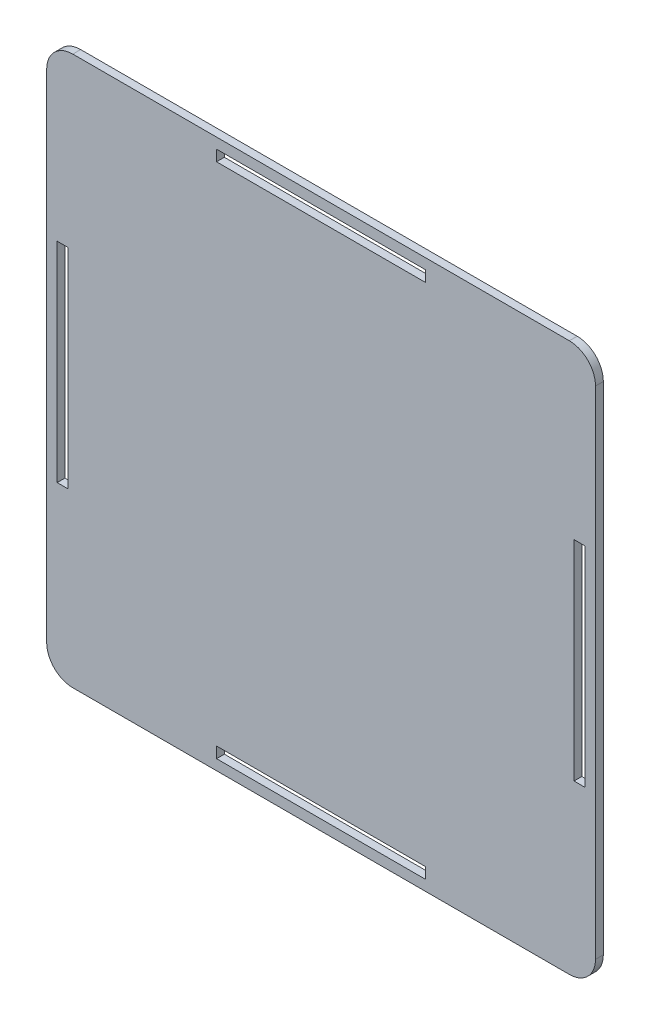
ISO-10303-21;
HEADER;
FILE_DESCRIPTION(('STEP AP214'),'2;1');
FILE_NAME('part.step','',(''),(''),'','','');
FILE_SCHEMA(('AUTOMOTIVE_DESIGN { 1 0 10303 214 1 1 1 1 }'));
ENDSEC;
DATA;
#1=APPLICATION_CONTEXT('core data for automotive mechanical design processes');
#2=APPLICATION_PROTOCOL_DEFINITION('international standard','automotive_design',2000,#1);
#3=PRODUCT_CONTEXT('',#1,'mechanical');
#4=PRODUCT('Part','Part','',(#3));
#5=PRODUCT_RELATED_PRODUCT_CATEGORY('part','',(#4));
#6=PRODUCT_DEFINITION_FORMATION('','',#4);
#7=PRODUCT_DEFINITION_CONTEXT('part definition',#1,'design');
#8=PRODUCT_DEFINITION('design','',#6,#7);
#9=PRODUCT_DEFINITION_SHAPE('','',#8);
#10=(LENGTH_UNIT() NAMED_UNIT(*) SI_UNIT(.MILLI.,.METRE.));
#11=(NAMED_UNIT(*) PLANE_ANGLE_UNIT() SI_UNIT($,.RADIAN.));
#12=(NAMED_UNIT(*) SI_UNIT($,.STERADIAN.) SOLID_ANGLE_UNIT());
#13=UNCERTAINTY_MEASURE_WITH_UNIT(LENGTH_MEASURE(1.E-05),#10,'distance_accuracy_value','');
#14=(GEOMETRIC_REPRESENTATION_CONTEXT(3) GLOBAL_UNCERTAINTY_ASSIGNED_CONTEXT((#13)) GLOBAL_UNIT_ASSIGNED_CONTEXT((#10,
#11,#12)) REPRESENTATION_CONTEXT('',''));
#15=CARTESIAN_POINT('',(0.,0.,0.));
#16=DIRECTION('',(0.,0.,1.));
#17=DIRECTION('',(1.,0.,0.));
#18=AXIS2_PLACEMENT_3D('',#15,#16,#17);
#19=CARTESIAN_POINT('',(-47.4999999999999,-47.5,1.5));
#20=DIRECTION('',(0.,0.,1.));
#21=DIRECTION('',(1.,0.,0.));
#22=AXIS2_PLACEMENT_3D('',#19,#20,#21);
#23=PLANE('',#22);
#24=CARTESIAN_POINT('',(-47.4999999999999,-47.5,1.5));
#25=DIRECTION('',(0.,0.,1.));
#26=DIRECTION('',(1.,0.,0.));
#27=AXIS2_PLACEMENT_3D('',#24,#25,#26);
#28=CIRCLE('',#27,5.);
#29=CARTESIAN_POINT('',(-52.4999999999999,-47.5,1.5));
#30=VERTEX_POINT('',#29);
#31=CARTESIAN_POINT('',(-47.4999999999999,-52.5,1.5));
#32=VERTEX_POINT('',#31);
#33=EDGE_CURVE('E378',#30,#32,#28,.T.);
#34=ORIENTED_EDGE('',*,*,#33,.T.);
#35=DIRECTION('',(1.,0.,0.));
#36=VECTOR('',#35,1.);
#37=CARTESIAN_POINT('',(-47.4999999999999,-52.5,1.5));
#38=LINE('',#37,#36);
#39=CARTESIAN_POINT('',(47.5,-52.5,1.5));
#40=VERTEX_POINT('',#39);
#41=EDGE_CURVE('E382',#32,#40,#38,.T.);
#42=ORIENTED_EDGE('',*,*,#41,.T.);
#43=CARTESIAN_POINT('',(47.5,-47.5,1.5));
#44=DIRECTION('',(0.,0.,1.));
#45=DIRECTION('',(1.,0.,0.));
#46=AXIS2_PLACEMENT_3D('',#43,#44,#45);
#47=CIRCLE('',#46,5.);
#48=CARTESIAN_POINT('',(52.5,-47.5,1.5));
#49=VERTEX_POINT('',#48);
#50=EDGE_CURVE('E386',#40,#49,#47,.T.);
#51=ORIENTED_EDGE('',*,*,#50,.T.);
#52=DIRECTION('',(0.,1.,0.));
#53=VECTOR('',#52,1.);
#54=CARTESIAN_POINT('',(52.5,47.4999999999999,1.5));
#55=LINE('',#54,#53);
#56=CARTESIAN_POINT('',(52.5,47.4999999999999,1.5));
#57=VERTEX_POINT('',#56);
#58=EDGE_CURVE('E389',#49,#57,#55,.T.);
#59=ORIENTED_EDGE('',*,*,#58,.T.);
#60=CARTESIAN_POINT('',(47.5,47.5,1.5));
#61=DIRECTION('',(0.,0.,1.));
#62=DIRECTION('',(-1.,0.,0.));
#63=AXIS2_PLACEMENT_3D('',#60,#61,#62);
#64=CIRCLE('',#63,5.);
#65=CARTESIAN_POINT('',(47.5,52.5,1.5));
#66=VERTEX_POINT('',#65);
#67=EDGE_CURVE('E392',#57,#66,#64,.T.);
#68=ORIENTED_EDGE('',*,*,#67,.T.);
#69=DIRECTION('',(-1.,0.,0.));
#70=VECTOR('',#69,1.);
#71=CARTESIAN_POINT('',(-47.4999999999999,52.5,1.5));
#72=LINE('',#71,#70);
#73=CARTESIAN_POINT('',(-47.4999999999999,52.5,1.5));
#74=VERTEX_POINT('',#73);
#75=EDGE_CURVE('E395',#66,#74,#72,.T.);
#76=ORIENTED_EDGE('',*,*,#75,.T.);
#77=CARTESIAN_POINT('',(-47.4999999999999,47.5,1.5));
#78=DIRECTION('',(0.,0.,1.));
#79=DIRECTION('',(1.,0.,0.));
#80=AXIS2_PLACEMENT_3D('',#77,#78,#79);
#81=CIRCLE('',#80,5.);
#82=CARTESIAN_POINT('',(-52.4999999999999,47.4999999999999,1.5));
#83=VERTEX_POINT('',#82);
#84=EDGE_CURVE('E398',#74,#83,#81,.T.);
#85=ORIENTED_EDGE('',*,*,#84,.T.);
#86=DIRECTION('',(0.,-1.,0.));
#87=VECTOR('',#86,1.);
#88=CARTESIAN_POINT('',(-52.4999999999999,47.4999999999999,1.5));
#89=LINE('',#88,#87);
#90=EDGE_CURVE('E401',#83,#30,#89,.T.);
#91=ORIENTED_EDGE('',*,*,#90,.T.);
#92=EDGE_LOOP('',(#34,#42,#51,#59,#68,#76,#85,#91));
#93=FACE_BOUND('',#92,.T.);
#94=DIRECTION('',(1.,0.,0.));
#95=VECTOR('',#94,1.);
#96=CARTESIAN_POINT('',(-50.4999999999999,-20.,1.5));
#97=LINE('',#96,#95);
#98=CARTESIAN_POINT('',(-50.4999999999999,-20.,1.5));
#99=VERTEX_POINT('',#98);
#100=CARTESIAN_POINT('',(-48.3999999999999,-20.,1.5));
#101=VERTEX_POINT('',#100);
#102=EDGE_CURVE('E338',#99,#101,#97,.T.);
#103=ORIENTED_EDGE('',*,*,#102,.F.);
#104=DIRECTION('',(0.,-1.,0.));
#105=VECTOR('',#104,1.);
#106=CARTESIAN_POINT('',(-50.4999999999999,20.,1.5));
#107=LINE('',#106,#105);
#108=CARTESIAN_POINT('',(-50.4999999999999,20.,1.5));
#109=VERTEX_POINT('',#108);
#110=EDGE_CURVE('E335',#109,#99,#107,.T.);
#111=ORIENTED_EDGE('',*,*,#110,.F.);
#112=DIRECTION('',(-1.,0.,0.));
#113=VECTOR('',#112,1.);
#114=CARTESIAN_POINT('',(-50.4999999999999,20.,1.5));
#115=LINE('',#114,#113);
#116=CARTESIAN_POINT('',(-48.3999999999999,20.,1.5));
#117=VERTEX_POINT('',#116);
#118=EDGE_CURVE('E346',#117,#109,#115,.T.);
#119=ORIENTED_EDGE('',*,*,#118,.F.);
#120=DIRECTION('',(0.,1.,0.));
#121=VECTOR('',#120,1.);
#122=CARTESIAN_POINT('',(-48.3999999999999,20.,1.5));
#123=LINE('',#122,#121);
#124=EDGE_CURVE('E342',#101,#117,#123,.T.);
#125=ORIENTED_EDGE('',*,*,#124,.F.);
#126=EDGE_LOOP('',(#103,#111,#119,#125));
#127=FACE_BOUND('',#126,.T.);
#128=DIRECTION('',(0.,-1.,0.));
#129=VECTOR('',#128,1.);
#130=CARTESIAN_POINT('',(-20.0000000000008,50.5000000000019,1.5));
#131=LINE('',#130,#129);
#132=CARTESIAN_POINT('',(-20.0000000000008,50.5000000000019,1.5));
#133=VERTEX_POINT('',#132);
#134=CARTESIAN_POINT('',(-20.0000000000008,48.4000000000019,1.5));
#135=VERTEX_POINT('',#134);
#136=EDGE_CURVE('E295',#133,#135,#131,.T.);
#137=ORIENTED_EDGE('',*,*,#136,.F.);
#138=DIRECTION('',(-1.,0.,0.));
#139=VECTOR('',#138,1.);
#140=CARTESIAN_POINT('',(19.9999999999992,50.5000000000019,1.5));
#141=LINE('',#140,#139);
#142=CARTESIAN_POINT('',(19.9999999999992,50.5000000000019,1.5));
#143=VERTEX_POINT('',#142);
#144=EDGE_CURVE('E292',#143,#133,#141,.T.);
#145=ORIENTED_EDGE('',*,*,#144,.F.);
#146=DIRECTION('',(0.,1.,0.));
#147=VECTOR('',#146,1.);
#148=CARTESIAN_POINT('',(19.9999999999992,50.5000000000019,1.5));
#149=LINE('',#148,#147);
#150=CARTESIAN_POINT('',(19.9999999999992,48.4000000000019,1.5));
#151=VERTEX_POINT('',#150);
#152=EDGE_CURVE('E303',#151,#143,#149,.T.);
#153=ORIENTED_EDGE('',*,*,#152,.F.);
#154=DIRECTION('',(1.,0.,0.));
#155=VECTOR('',#154,1.);
#156=CARTESIAN_POINT('',(19.9999999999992,48.4000000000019,1.5));
#157=LINE('',#156,#155);
#158=EDGE_CURVE('E299',#135,#151,#157,.T.);
#159=ORIENTED_EDGE('',*,*,#158,.F.);
#160=EDGE_LOOP('',(#137,#145,#153,#159));
#161=FACE_BOUND('',#160,.T.);
#162=DIRECTION('',(-1.,0.,0.));
#163=VECTOR('',#162,1.);
#164=CARTESIAN_POINT('',(50.5000000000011,20.0000000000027,1.5));
#165=LINE('',#164,#163);
#166=CARTESIAN_POINT('',(50.5000000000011,20.0000000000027,1.5));
#167=VERTEX_POINT('',#166);
#168=CARTESIAN_POINT('',(48.4000000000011,20.0000000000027,1.5));
#169=VERTEX_POINT('',#168);
#170=EDGE_CURVE('E252',#167,#169,#165,.T.);
#171=ORIENTED_EDGE('',*,*,#170,.F.);
#172=DIRECTION('',(0.,1.,0.));
#173=VECTOR('',#172,1.);
#174=CARTESIAN_POINT('',(50.5000000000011,-19.9999999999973,1.5));
#175=LINE('',#174,#173);
#176=CARTESIAN_POINT('',(50.5000000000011,-19.9999999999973,1.5));
#177=VERTEX_POINT('',#176);
#178=EDGE_CURVE('E249',#177,#167,#175,.T.);
#179=ORIENTED_EDGE('',*,*,#178,.F.);
#180=DIRECTION('',(1.,0.,0.));
#181=VECTOR('',#180,1.);
#182=CARTESIAN_POINT('',(50.5000000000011,-19.9999999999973,1.5));
#183=LINE('',#182,#181);
#184=CARTESIAN_POINT('',(48.4000000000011,-19.9999999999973,1.5));
#185=VERTEX_POINT('',#184);
#186=EDGE_CURVE('E260',#185,#177,#183,.T.);
#187=ORIENTED_EDGE('',*,*,#186,.F.);
#188=DIRECTION('',(0.,-1.,0.));
#189=VECTOR('',#188,1.);
#190=CARTESIAN_POINT('',(48.4000000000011,-19.9999999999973,1.5));
#191=LINE('',#190,#189);
#192=EDGE_CURVE('E256',#169,#185,#191,.T.);
#193=ORIENTED_EDGE('',*,*,#192,.F.);
#194=EDGE_LOOP('',(#171,#179,#187,#193));
#195=FACE_BOUND('',#194,.T.);
#196=DIRECTION('',(0.,1.,0.));
#197=VECTOR('',#196,1.);
#198=CARTESIAN_POINT('',(20.000000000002,-50.4999999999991,1.5));
#199=LINE('',#198,#197);
#200=CARTESIAN_POINT('',(20.000000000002,-50.4999999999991,1.5));
#201=VERTEX_POINT('',#200);
#202=CARTESIAN_POINT('',(20.000000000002,-48.3999999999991,1.5));
#203=VERTEX_POINT('',#202);
#204=EDGE_CURVE('E210',#201,#203,#199,.T.);
#205=ORIENTED_EDGE('',*,*,#204,.F.);
#206=DIRECTION('',(1.,0.,0.));
#207=VECTOR('',#206,1.);
#208=CARTESIAN_POINT('',(-19.999999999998,-50.4999999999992,1.5));
#209=LINE('',#208,#207);
#210=CARTESIAN_POINT('',(-19.999999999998,-50.4999999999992,1.5));
#211=VERTEX_POINT('',#210);
#212=EDGE_CURVE('E201',#211,#201,#209,.T.);
#213=ORIENTED_EDGE('',*,*,#212,.F.);
#214=DIRECTION('',(0.,-1.,0.));
#215=VECTOR('',#214,1.);
#216=CARTESIAN_POINT('',(-19.999999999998,-50.4999999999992,1.5));
#217=LINE('',#216,#215);
#218=CARTESIAN_POINT('',(-19.999999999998,-48.3999999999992,1.5));
#219=VERTEX_POINT('',#218);
#220=EDGE_CURVE('E227',#219,#211,#217,.T.);
#221=ORIENTED_EDGE('',*,*,#220,.F.);
#222=DIRECTION('',(-1.,0.,0.));
#223=VECTOR('',#222,1.);
#224=CARTESIAN_POINT('',(-19.999999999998,-48.3999999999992,1.5));
#225=LINE('',#224,#223);
#226=EDGE_CURVE('E223',#203,#219,#225,.T.);
#227=ORIENTED_EDGE('',*,*,#226,.F.);
#228=EDGE_LOOP('',(#205,#213,#221,#227));
#229=FACE_BOUND('',#228,.T.);
#230=ADVANCED_FACE('F39',(#93,#127,#161,#195,#229),#23,.T.);
#231=CARTESIAN_POINT('',(-47.4999999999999,-47.5,0.));
#232=DIRECTION('',(0.,0.,1.));
#233=DIRECTION('',(1.,0.,0.));
#234=AXIS2_PLACEMENT_3D('',#231,#232,#233);
#235=PLANE('',#234);
#236=DIRECTION('',(0.,1.,0.));
#237=VECTOR('',#236,1.);
#238=CARTESIAN_POINT('',(50.5000000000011,-19.9999999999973,0.));
#239=LINE('',#238,#237);
#240=CARTESIAN_POINT('',(50.5000000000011,-19.9999999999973,0.));
#241=VERTEX_POINT('',#240);
#242=CARTESIAN_POINT('',(50.5000000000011,20.0000000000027,0.));
#243=VERTEX_POINT('',#242);
#244=EDGE_CURVE('E219',#241,#243,#239,.T.);
#245=ORIENTED_EDGE('',*,*,#244,.T.);
#246=DIRECTION('',(-1.,0.,0.));
#247=VECTOR('',#246,1.);
#248=CARTESIAN_POINT('',(50.5000000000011,20.0000000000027,0.));
#249=LINE('',#248,#247);
#250=CARTESIAN_POINT('',(48.4000000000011,20.0000000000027,0.));
#251=VERTEX_POINT('',#250);
#252=EDGE_CURVE('E267',#243,#251,#249,.T.);
#253=ORIENTED_EDGE('',*,*,#252,.T.);
#254=DIRECTION('',(0.,-1.,0.));
#255=VECTOR('',#254,1.);
#256=CARTESIAN_POINT('',(48.4000000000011,-19.9999999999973,0.));
#257=LINE('',#256,#255);
#258=CARTESIAN_POINT('',(48.4000000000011,-19.9999999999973,0.));
#259=VERTEX_POINT('',#258);
#260=EDGE_CURVE('E271',#251,#259,#257,.T.);
#261=ORIENTED_EDGE('',*,*,#260,.T.);
#262=DIRECTION('',(1.,0.,0.));
#263=VECTOR('',#262,1.);
#264=CARTESIAN_POINT('',(50.5000000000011,-19.9999999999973,0.));
#265=LINE('',#264,#263);
#266=EDGE_CURVE('E253',#259,#241,#265,.T.);
#267=ORIENTED_EDGE('',*,*,#266,.T.);
#268=EDGE_LOOP('',(#245,#253,#261,#267));
#269=FACE_BOUND('',#268,.T.);
#270=DIRECTION('',(0.,-1.,0.));
#271=VECTOR('',#270,1.);
#272=CARTESIAN_POINT('',(-50.4999999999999,20.,0.));
#273=LINE('',#272,#271);
#274=CARTESIAN_POINT('',(-50.4999999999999,20.,0.));
#275=VERTEX_POINT('',#274);
#276=CARTESIAN_POINT('',(-50.4999999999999,-20.,0.));
#277=VERTEX_POINT('',#276);
#278=EDGE_CURVE('E334',#275,#277,#273,.T.);
#279=ORIENTED_EDGE('',*,*,#278,.T.);
#280=DIRECTION('',(1.,0.,0.));
#281=VECTOR('',#280,1.);
#282=CARTESIAN_POINT('',(-50.4999999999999,-20.,0.));
#283=LINE('',#282,#281);
#284=CARTESIAN_POINT('',(-48.3999999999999,-20.,0.));
#285=VERTEX_POINT('',#284);
#286=EDGE_CURVE('E353',#277,#285,#283,.T.);
#287=ORIENTED_EDGE('',*,*,#286,.T.);
#288=DIRECTION('',(0.,1.,0.));
#289=VECTOR('',#288,1.);
#290=CARTESIAN_POINT('',(-48.3999999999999,20.,0.));
#291=LINE('',#290,#289);
#292=CARTESIAN_POINT('',(-48.3999999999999,20.,0.));
#293=VERTEX_POINT('',#292);
#294=EDGE_CURVE('E357',#285,#293,#291,.T.);
#295=ORIENTED_EDGE('',*,*,#294,.T.);
#296=DIRECTION('',(-1.,0.,0.));
#297=VECTOR('',#296,1.);
#298=CARTESIAN_POINT('',(-50.4999999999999,20.,0.));
#299=LINE('',#298,#297);
#300=EDGE_CURVE('E339',#293,#275,#299,.T.);
#301=ORIENTED_EDGE('',*,*,#300,.T.);
#302=EDGE_LOOP('',(#279,#287,#295,#301));
#303=FACE_BOUND('',#302,.T.);
#304=CARTESIAN_POINT('',(-47.4999999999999,-47.5,0.));
#305=DIRECTION('',(0.,0.,1.));
#306=DIRECTION('',(1.,0.,0.));
#307=AXIS2_PLACEMENT_3D('',#304,#305,#306);
#308=CIRCLE('',#307,5.);
#309=CARTESIAN_POINT('',(-52.4999999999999,-47.5,0.));
#310=VERTEX_POINT('',#309);
#311=CARTESIAN_POINT('',(-47.4999999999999,-52.5,0.));
#312=VERTEX_POINT('',#311);
#313=EDGE_CURVE('E377',#310,#312,#308,.T.);
#314=ORIENTED_EDGE('',*,*,#313,.F.);
#315=DIRECTION('',(0.,-1.,0.));
#316=VECTOR('',#315,1.);
#317=CARTESIAN_POINT('',(-52.4999999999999,47.4999999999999,0.));
#318=LINE('',#317,#316);
#319=CARTESIAN_POINT('',(-52.4999999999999,47.4999999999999,0.));
#320=VERTEX_POINT('',#319);
#321=EDGE_CURVE('E383',#320,#310,#318,.T.);
#322=ORIENTED_EDGE('',*,*,#321,.F.);
#323=CARTESIAN_POINT('',(-47.4999999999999,47.5,0.));
#324=DIRECTION('',(0.,0.,1.));
#325=DIRECTION('',(1.,0.,0.));
#326=AXIS2_PLACEMENT_3D('',#323,#324,#325);
#327=CIRCLE('',#326,5.);
#328=CARTESIAN_POINT('',(-47.4999999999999,52.5,0.));
#329=VERTEX_POINT('',#328);
#330=EDGE_CURVE('E423',#329,#320,#327,.T.);
#331=ORIENTED_EDGE('',*,*,#330,.F.);
#332=DIRECTION('',(-1.,0.,0.));
#333=VECTOR('',#332,1.);
#334=CARTESIAN_POINT('',(-47.4999999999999,52.5,0.));
#335=LINE('',#334,#333);
#336=CARTESIAN_POINT('',(47.5,52.5,0.));
#337=VERTEX_POINT('',#336);
#338=EDGE_CURVE('E420',#337,#329,#335,.T.);
#339=ORIENTED_EDGE('',*,*,#338,.F.);
#340=CARTESIAN_POINT('',(47.5,47.5,0.));
#341=DIRECTION('',(0.,0.,1.));
#342=DIRECTION('',(-1.,0.,0.));
#343=AXIS2_PLACEMENT_3D('',#340,#341,#342);
#344=CIRCLE('',#343,5.);
#345=CARTESIAN_POINT('',(52.5,47.4999999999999,0.));
#346=VERTEX_POINT('',#345);
#347=EDGE_CURVE('E417',#346,#337,#344,.T.);
#348=ORIENTED_EDGE('',*,*,#347,.F.);
#349=DIRECTION('',(0.,1.,0.));
#350=VECTOR('',#349,1.);
#351=CARTESIAN_POINT('',(52.5,47.4999999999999,0.));
#352=LINE('',#351,#350);
#353=CARTESIAN_POINT('',(52.5,-47.5,0.));
#354=VERTEX_POINT('',#353);
#355=EDGE_CURVE('E414',#354,#346,#352,.T.);
#356=ORIENTED_EDGE('',*,*,#355,.F.);
#357=CARTESIAN_POINT('',(47.5,-47.5,0.));
#358=DIRECTION('',(0.,0.,1.));
#359=DIRECTION('',(1.,0.,0.));
#360=AXIS2_PLACEMENT_3D('',#357,#358,#359);
#361=CIRCLE('',#360,5.);
#362=CARTESIAN_POINT('',(47.5,-52.5,0.));
#363=VERTEX_POINT('',#362);
#364=EDGE_CURVE('E411',#363,#354,#361,.T.);
#365=ORIENTED_EDGE('',*,*,#364,.F.);
#366=DIRECTION('',(1.,0.,0.));
#367=VECTOR('',#366,1.);
#368=CARTESIAN_POINT('',(-47.4999999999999,-52.5,0.));
#369=LINE('',#368,#367);
#370=EDGE_CURVE('E408',#312,#363,#369,.T.);
#371=ORIENTED_EDGE('',*,*,#370,.F.);
#372=EDGE_LOOP('',(#314,#322,#331,#339,#348,#356,#365,#371));
#373=FACE_BOUND('',#372,.T.);
#374=DIRECTION('',(-1.,0.,0.));
#375=VECTOR('',#374,1.);
#376=CARTESIAN_POINT('',(19.9999999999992,50.5000000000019,0.));
#377=LINE('',#376,#375);
#378=CARTESIAN_POINT('',(19.9999999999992,50.5000000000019,0.));
#379=VERTEX_POINT('',#378);
#380=CARTESIAN_POINT('',(-20.0000000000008,50.5000000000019,0.));
#381=VERTEX_POINT('',#380);
#382=EDGE_CURVE('E291',#379,#381,#377,.T.);
#383=ORIENTED_EDGE('',*,*,#382,.T.);
#384=DIRECTION('',(0.,-1.,0.));
#385=VECTOR('',#384,1.);
#386=CARTESIAN_POINT('',(-20.0000000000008,50.5000000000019,0.));
#387=LINE('',#386,#385);
#388=CARTESIAN_POINT('',(-20.0000000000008,48.4000000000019,0.));
#389=VERTEX_POINT('',#388);
#390=EDGE_CURVE('E310',#381,#389,#387,.T.);
#391=ORIENTED_EDGE('',*,*,#390,.T.);
#392=DIRECTION('',(1.,0.,0.));
#393=VECTOR('',#392,1.);
#394=CARTESIAN_POINT('',(19.9999999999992,48.4000000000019,0.));
#395=LINE('',#394,#393);
#396=CARTESIAN_POINT('',(19.9999999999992,48.4000000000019,0.));
#397=VERTEX_POINT('',#396);
#398=EDGE_CURVE('E314',#389,#397,#395,.T.);
#399=ORIENTED_EDGE('',*,*,#398,.T.);
#400=DIRECTION('',(0.,1.,0.));
#401=VECTOR('',#400,1.);
#402=CARTESIAN_POINT('',(19.9999999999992,50.5000000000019,0.));
#403=LINE('',#402,#401);
#404=EDGE_CURVE('E296',#397,#379,#403,.T.);
#405=ORIENTED_EDGE('',*,*,#404,.T.);
#406=EDGE_LOOP('',(#383,#391,#399,#405));
#407=FACE_BOUND('',#406,.T.);
#408=DIRECTION('',(1.,0.,0.));
#409=VECTOR('',#408,1.);
#410=CARTESIAN_POINT('',(-19.999999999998,-50.4999999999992,0.));
#411=LINE('',#410,#409);
#412=CARTESIAN_POINT('',(-19.999999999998,-50.4999999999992,0.));
#413=VERTEX_POINT('',#412);
#414=CARTESIAN_POINT('',(20.000000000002,-50.4999999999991,0.));
#415=VERTEX_POINT('',#414);
#416=EDGE_CURVE('E63',#413,#415,#411,.T.);
#417=ORIENTED_EDGE('',*,*,#416,.T.);
#418=DIRECTION('',(0.,1.,0.));
#419=VECTOR('',#418,1.);
#420=CARTESIAN_POINT('',(20.000000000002,-50.4999999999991,0.));
#421=LINE('',#420,#419);
#422=CARTESIAN_POINT('',(20.000000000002,-48.3999999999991,0.));
#423=VERTEX_POINT('',#422);
#424=EDGE_CURVE('E217',#415,#423,#421,.T.);
#425=ORIENTED_EDGE('',*,*,#424,.T.);
#426=DIRECTION('',(-1.,0.,0.));
#427=VECTOR('',#426,1.);
#428=CARTESIAN_POINT('',(-19.999999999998,-48.3999999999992,0.));
#429=LINE('',#428,#427);
#430=CARTESIAN_POINT('',(-19.999999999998,-48.3999999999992,0.));
#431=VERTEX_POINT('',#430);
#432=EDGE_CURVE('E236',#423,#431,#429,.T.);
#433=ORIENTED_EDGE('',*,*,#432,.T.);
#434=DIRECTION('',(0.,-1.,0.));
#435=VECTOR('',#434,1.);
#436=CARTESIAN_POINT('',(-19.999999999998,-50.4999999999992,0.));
#437=LINE('',#436,#435);
#438=EDGE_CURVE('E211',#431,#413,#437,.T.);
#439=ORIENTED_EDGE('',*,*,#438,.T.);
#440=EDGE_LOOP('',(#417,#425,#433,#439));
#441=FACE_BOUND('',#440,.T.);
#442=ADVANCED_FACE('F462',(#269,#303,#373,#407,#441),#235,.F.);
#443=CARTESIAN_POINT('',(-47.4999999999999,-47.5,1.5));
#444=DIRECTION('',(0.,0.,-1.));
#445=DIRECTION('',(-1.,0.,0.));
#446=AXIS2_PLACEMENT_3D('',#443,#444,#445);
#447=CYLINDRICAL_SURFACE('',#446,5.);
#448=ORIENTED_EDGE('',*,*,#313,.T.);
#449=DIRECTION('',(0.,0.,-1.));
#450=VECTOR('',#449,1.);
#451=CARTESIAN_POINT('',(-47.4999999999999,-52.5,1.5));
#452=LINE('',#451,#450);
#453=EDGE_CURVE('E11',#32,#312,#452,.T.);
#454=ORIENTED_EDGE('',*,*,#453,.F.);
#455=ORIENTED_EDGE('',*,*,#33,.F.);
#456=DIRECTION('',(0.,0.,-1.));
#457=VECTOR('',#456,1.);
#458=CARTESIAN_POINT('',(-52.4999999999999,-47.5,1.5));
#459=LINE('',#458,#457);
#460=EDGE_CURVE('E404',#30,#310,#459,.T.);
#461=ORIENTED_EDGE('',*,*,#460,.T.);
#462=EDGE_LOOP('',(#448,#454,#455,#461));
#463=FACE_BOUND('',#462,.T.);
#464=ADVANCED_FACE('F41',(#463),#447,.T.);
#465=CARTESIAN_POINT('',(-47.4999999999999,-52.5,1.5));
#466=DIRECTION('',(0.,1.,0.));
#467=DIRECTION('',(0.,0.,1.));
#468=AXIS2_PLACEMENT_3D('',#465,#466,#467);
#469=PLANE('',#468);
#470=ORIENTED_EDGE('',*,*,#370,.T.);
#471=DIRECTION('',(0.,0.,-1.));
#472=VECTOR('',#471,1.);
#473=CARTESIAN_POINT('',(47.5,-52.5,1.5));
#474=LINE('',#473,#472);
#475=EDGE_CURVE('E48',#40,#363,#474,.T.);
#476=ORIENTED_EDGE('',*,*,#475,.F.);
#477=ORIENTED_EDGE('',*,*,#41,.F.);
#478=ORIENTED_EDGE('',*,*,#453,.T.);
#479=EDGE_LOOP('',(#470,#476,#477,#478));
#480=FACE_BOUND('',#479,.T.);
#481=ADVANCED_FACE('F480',(#480),#469,.F.);
#482=CARTESIAN_POINT('',(47.5,-47.5,1.5));
#483=DIRECTION('',(0.,0.,-1.));
#484=DIRECTION('',(-1.,0.,0.));
#485=AXIS2_PLACEMENT_3D('',#482,#483,#484);
#486=CYLINDRICAL_SURFACE('',#485,5.);
#487=ORIENTED_EDGE('',*,*,#364,.T.);
#488=DIRECTION('',(0.,0.,-1.));
#489=VECTOR('',#488,1.);
#490=CARTESIAN_POINT('',(52.5,-47.5,1.5));
#491=LINE('',#490,#489);
#492=EDGE_CURVE('E447',#49,#354,#491,.T.);
#493=ORIENTED_EDGE('',*,*,#492,.F.);
#494=ORIENTED_EDGE('',*,*,#50,.F.);
#495=ORIENTED_EDGE('',*,*,#475,.T.);
#496=EDGE_LOOP('',(#487,#493,#494,#495));
#497=FACE_BOUND('',#496,.T.);
#498=ADVANCED_FACE('F456',(#497),#486,.T.);
#499=CARTESIAN_POINT('',(52.5,47.4999999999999,1.5));
#500=DIRECTION('',(-1.,0.,0.));
#501=DIRECTION('',(0.,-1.,0.));
#502=AXIS2_PLACEMENT_3D('',#499,#500,#501);
#503=PLANE('',#502);
#504=ORIENTED_EDGE('',*,*,#355,.T.);
#505=DIRECTION('',(0.,0.,-1.));
#506=VECTOR('',#505,1.);
#507=CARTESIAN_POINT('',(52.5,47.4999999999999,1.5));
#508=LINE('',#507,#506);
#509=EDGE_CURVE('E443',#57,#346,#508,.T.);
#510=ORIENTED_EDGE('',*,*,#509,.F.);
#511=ORIENTED_EDGE('',*,*,#58,.F.);
#512=ORIENTED_EDGE('',*,*,#492,.T.);
#513=EDGE_LOOP('',(#504,#510,#511,#512));
#514=FACE_BOUND('',#513,.T.);
#515=ADVANCED_FACE('F468',(#514),#503,.F.);
#516=CARTESIAN_POINT('',(47.5,47.5,1.5));
#517=DIRECTION('',(0.,0.,-1.));
#518=DIRECTION('',(-1.,0.,0.));
#519=AXIS2_PLACEMENT_3D('',#516,#517,#518);
#520=CYLINDRICAL_SURFACE('',#519,5.);
#521=ORIENTED_EDGE('',*,*,#347,.T.);
#522=DIRECTION('',(0.,0.,-1.));
#523=VECTOR('',#522,1.);
#524=CARTESIAN_POINT('',(47.5,52.5,1.5));
#525=LINE('',#524,#523);
#526=EDGE_CURVE('E439',#66,#337,#525,.T.);
#527=ORIENTED_EDGE('',*,*,#526,.F.);
#528=ORIENTED_EDGE('',*,*,#67,.F.);
#529=ORIENTED_EDGE('',*,*,#509,.T.);
#530=EDGE_LOOP('',(#521,#527,#528,#529));
#531=FACE_BOUND('',#530,.T.);
#532=ADVANCED_FACE('F472',(#531),#520,.T.);
#533=CARTESIAN_POINT('',(-47.4999999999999,52.5,1.5));
#534=DIRECTION('',(0.,-1.,0.));
#535=DIRECTION('',(0.,0.,-1.));
#536=AXIS2_PLACEMENT_3D('',#533,#534,#535);
#537=PLANE('',#536);
#538=ORIENTED_EDGE('',*,*,#338,.T.);
#539=DIRECTION('',(0.,0.,-1.));
#540=VECTOR('',#539,1.);
#541=CARTESIAN_POINT('',(-47.4999999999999,52.5,1.5));
#542=LINE('',#541,#540);
#543=EDGE_CURVE('E435',#74,#329,#542,.T.);
#544=ORIENTED_EDGE('',*,*,#543,.F.);
#545=ORIENTED_EDGE('',*,*,#75,.F.);
#546=ORIENTED_EDGE('',*,*,#526,.T.);
#547=EDGE_LOOP('',(#538,#544,#545,#546));
#548=FACE_BOUND('',#547,.T.);
#549=ADVANCED_FACE('F493',(#548),#537,.F.);
#550=CARTESIAN_POINT('',(-47.4999999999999,47.5,1.5));
#551=DIRECTION('',(0.,0.,-1.));
#552=DIRECTION('',(-1.,0.,0.));
#553=AXIS2_PLACEMENT_3D('',#550,#551,#552);
#554=CYLINDRICAL_SURFACE('',#553,5.);
#555=ORIENTED_EDGE('',*,*,#330,.T.);
#556=DIRECTION('',(0.,0.,-1.));
#557=VECTOR('',#556,1.);
#558=CARTESIAN_POINT('',(-52.4999999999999,47.4999999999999,1.5));
#559=LINE('',#558,#557);
#560=EDGE_CURVE('E431',#83,#320,#559,.T.);
#561=ORIENTED_EDGE('',*,*,#560,.F.);
#562=ORIENTED_EDGE('',*,*,#84,.F.);
#563=ORIENTED_EDGE('',*,*,#543,.T.);
#564=EDGE_LOOP('',(#555,#561,#562,#563));
#565=FACE_BOUND('',#564,.T.);
#566=ADVANCED_FACE('F491',(#565),#554,.T.);
#567=CARTESIAN_POINT('',(-52.4999999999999,47.4999999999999,1.5));
#568=DIRECTION('',(1.,0.,0.));
#569=DIRECTION('',(0.,0.,-1.));
#570=AXIS2_PLACEMENT_3D('',#567,#568,#569);
#571=PLANE('',#570);
#572=ORIENTED_EDGE('',*,*,#321,.T.);
#573=ORIENTED_EDGE('',*,*,#460,.F.);
#574=ORIENTED_EDGE('',*,*,#90,.F.);
#575=ORIENTED_EDGE('',*,*,#560,.T.);
#576=EDGE_LOOP('',(#572,#573,#574,#575));
#577=FACE_BOUND('',#576,.T.);
#578=ADVANCED_FACE('F486',(#577),#571,.F.);
#579=CARTESIAN_POINT('',(-50.4999999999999,20.,1.5));
#580=DIRECTION('',(1.,0.,0.));
#581=DIRECTION('',(0.,1.,0.));
#582=AXIS2_PLACEMENT_3D('',#579,#580,#581);
#583=PLANE('',#582);
#584=ORIENTED_EDGE('',*,*,#278,.F.);
#585=DIRECTION('',(0.,0.,-1.));
#586=VECTOR('',#585,1.);
#587=CARTESIAN_POINT('',(-50.4999999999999,20.,1.5));
#588=LINE('',#587,#586);
#589=EDGE_CURVE('E349',#109,#275,#588,.T.);
#590=ORIENTED_EDGE('',*,*,#589,.F.);
#591=ORIENTED_EDGE('',*,*,#110,.T.);
#592=DIRECTION('',(0.,0.,-1.));
#593=VECTOR('',#592,1.);
#594=CARTESIAN_POINT('',(-50.4999999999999,-20.,1.5));
#595=LINE('',#594,#593);
#596=EDGE_CURVE('E373',#99,#277,#595,.T.);
#597=ORIENTED_EDGE('',*,*,#596,.T.);
#598=EDGE_LOOP('',(#584,#590,#591,#597));
#599=FACE_BOUND('',#598,.T.);
#600=ADVANCED_FACE('F510',(#599),#583,.T.);
#601=CARTESIAN_POINT('',(-50.4999999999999,-20.,1.5));
#602=DIRECTION('',(0.,1.,0.));
#603=DIRECTION('',(0.,0.,1.));
#604=AXIS2_PLACEMENT_3D('',#601,#602,#603);
#605=PLANE('',#604);
#606=ORIENTED_EDGE('',*,*,#286,.F.);
#607=ORIENTED_EDGE('',*,*,#596,.F.);
#608=ORIENTED_EDGE('',*,*,#102,.T.);
#609=DIRECTION('',(0.,0.,-1.));
#610=VECTOR('',#609,1.);
#611=CARTESIAN_POINT('',(-48.3999999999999,-20.,1.5));
#612=LINE('',#611,#610);
#613=EDGE_CURVE('E370',#101,#285,#612,.T.);
#614=ORIENTED_EDGE('',*,*,#613,.T.);
#615=EDGE_LOOP('',(#606,#607,#608,#614));
#616=FACE_BOUND('',#615,.T.);
#617=ADVANCED_FACE('F517',(#616),#605,.T.);
#618=CARTESIAN_POINT('',(-48.3999999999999,20.,1.5));
#619=DIRECTION('',(-1.,0.,0.));
#620=DIRECTION('',(0.,-1.,0.));
#621=AXIS2_PLACEMENT_3D('',#618,#619,#620);
#622=PLANE('',#621);
#623=ORIENTED_EDGE('',*,*,#294,.F.);
#624=ORIENTED_EDGE('',*,*,#613,.F.);
#625=ORIENTED_EDGE('',*,*,#124,.T.);
#626=DIRECTION('',(0.,0.,-1.));
#627=VECTOR('',#626,1.);
#628=CARTESIAN_POINT('',(-48.3999999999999,20.,1.5));
#629=LINE('',#628,#627);
#630=EDGE_CURVE('E367',#117,#293,#629,.T.);
#631=ORIENTED_EDGE('',*,*,#630,.T.);
#632=EDGE_LOOP('',(#623,#624,#625,#631));
#633=FACE_BOUND('',#632,.T.);
#634=ADVANCED_FACE('F522',(#633),#622,.T.);
#635=CARTESIAN_POINT('',(-50.4999999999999,20.,1.5));
#636=DIRECTION('',(0.,-1.,0.));
#637=DIRECTION('',(0.,0.,-1.));
#638=AXIS2_PLACEMENT_3D('',#635,#636,#637);
#639=PLANE('',#638);
#640=ORIENTED_EDGE('',*,*,#300,.F.);
#641=ORIENTED_EDGE('',*,*,#630,.F.);
#642=ORIENTED_EDGE('',*,*,#118,.T.);
#643=ORIENTED_EDGE('',*,*,#589,.T.);
#644=EDGE_LOOP('',(#640,#641,#642,#643));
#645=FACE_BOUND('',#644,.T.);
#646=ADVANCED_FACE('F530',(#645),#639,.T.);
#647=CARTESIAN_POINT('',(19.9999999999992,50.5000000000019,1.5));
#648=DIRECTION('',(0.,-1.,0.));
#649=DIRECTION('',(1.,0.,0.));
#650=AXIS2_PLACEMENT_3D('',#647,#648,#649);
#651=PLANE('',#650);
#652=ORIENTED_EDGE('',*,*,#382,.F.);
#653=DIRECTION('',(0.,0.,-1.));
#654=VECTOR('',#653,1.);
#655=CARTESIAN_POINT('',(19.9999999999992,50.5000000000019,1.5));
#656=LINE('',#655,#654);
#657=EDGE_CURVE('E306',#143,#379,#656,.T.);
#658=ORIENTED_EDGE('',*,*,#657,.F.);
#659=ORIENTED_EDGE('',*,*,#144,.T.);
#660=DIRECTION('',(0.,0.,-1.));
#661=VECTOR('',#660,1.);
#662=CARTESIAN_POINT('',(-20.0000000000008,50.5000000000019,1.5));
#663=LINE('',#662,#661);
#664=EDGE_CURVE('E330',#133,#381,#663,.T.);
#665=ORIENTED_EDGE('',*,*,#664,.T.);
#666=EDGE_LOOP('',(#652,#658,#659,#665));
#667=FACE_BOUND('',#666,.T.);
#668=ADVANCED_FACE('F584',(#667),#651,.T.);
#669=CARTESIAN_POINT('',(-20.0000000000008,50.5000000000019,1.5));
#670=DIRECTION('',(1.,0.,0.));
#671=DIRECTION('',(0.,0.,-1.));
#672=AXIS2_PLACEMENT_3D('',#669,#670,#671);
#673=PLANE('',#672);
#674=ORIENTED_EDGE('',*,*,#390,.F.);
#675=ORIENTED_EDGE('',*,*,#664,.F.);
#676=ORIENTED_EDGE('',*,*,#136,.T.);
#677=DIRECTION('',(0.,0.,-1.));
#678=VECTOR('',#677,1.);
#679=CARTESIAN_POINT('',(-20.0000000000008,48.4000000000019,1.5));
#680=LINE('',#679,#678);
#681=EDGE_CURVE('E327',#135,#389,#680,.T.);
#682=ORIENTED_EDGE('',*,*,#681,.T.);
#683=EDGE_LOOP('',(#674,#675,#676,#682));
#684=FACE_BOUND('',#683,.T.);
#685=ADVANCED_FACE('F580',(#684),#673,.T.);
#686=CARTESIAN_POINT('',(19.9999999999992,48.4000000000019,1.5));
#687=DIRECTION('',(0.,1.,0.));
#688=DIRECTION('',(-1.,0.,0.));
#689=AXIS2_PLACEMENT_3D('',#686,#687,#688);
#690=PLANE('',#689);
#691=ORIENTED_EDGE('',*,*,#398,.F.);
#692=ORIENTED_EDGE('',*,*,#681,.F.);
#693=ORIENTED_EDGE('',*,*,#158,.T.);
#694=DIRECTION('',(0.,0.,-1.));
#695=VECTOR('',#694,1.);
#696=CARTESIAN_POINT('',(19.9999999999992,48.4000000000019,1.5));
#697=LINE('',#696,#695);
#698=EDGE_CURVE('E324',#151,#397,#697,.T.);
#699=ORIENTED_EDGE('',*,*,#698,.T.);
#700=EDGE_LOOP('',(#691,#692,#693,#699));
#701=FACE_BOUND('',#700,.T.);
#702=ADVANCED_FACE('F576',(#701),#690,.T.);
#703=CARTESIAN_POINT('',(19.9999999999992,50.5000000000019,1.5));
#704=DIRECTION('',(-1.,0.,0.));
#705=DIRECTION('',(0.,0.,1.));
#706=AXIS2_PLACEMENT_3D('',#703,#704,#705);
#707=PLANE('',#706);
#708=ORIENTED_EDGE('',*,*,#404,.F.);
#709=ORIENTED_EDGE('',*,*,#698,.F.);
#710=ORIENTED_EDGE('',*,*,#152,.T.);
#711=ORIENTED_EDGE('',*,*,#657,.T.);
#712=EDGE_LOOP('',(#708,#709,#710,#711));
#713=FACE_BOUND('',#712,.T.);
#714=ADVANCED_FACE('F573',(#713),#707,.T.);
#715=CARTESIAN_POINT('',(50.5000000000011,-19.9999999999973,1.5));
#716=DIRECTION('',(-1.,0.,0.));
#717=DIRECTION('',(0.,-1.,0.));
#718=AXIS2_PLACEMENT_3D('',#715,#716,#717);
#719=PLANE('',#718);
#720=ORIENTED_EDGE('',*,*,#244,.F.);
#721=DIRECTION('',(0.,0.,-1.));
#722=VECTOR('',#721,1.);
#723=CARTESIAN_POINT('',(50.5000000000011,-19.9999999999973,1.5));
#724=LINE('',#723,#722);
#725=EDGE_CURVE('E263',#177,#241,#724,.T.);
#726=ORIENTED_EDGE('',*,*,#725,.F.);
#727=ORIENTED_EDGE('',*,*,#178,.T.);
#728=DIRECTION('',(0.,0.,-1.));
#729=VECTOR('',#728,1.);
#730=CARTESIAN_POINT('',(50.5000000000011,20.0000000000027,1.5));
#731=LINE('',#730,#729);
#732=EDGE_CURVE('E287',#167,#243,#731,.T.);
#733=ORIENTED_EDGE('',*,*,#732,.T.);
#734=EDGE_LOOP('',(#720,#726,#727,#733));
#735=FACE_BOUND('',#734,.T.);
#736=ADVANCED_FACE('F555',(#735),#719,.T.);
#737=CARTESIAN_POINT('',(50.5000000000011,20.0000000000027,1.5));
#738=DIRECTION('',(0.,-1.,0.));
#739=DIRECTION('',(0.,0.,-1.));
#740=AXIS2_PLACEMENT_3D('',#737,#738,#739);
#741=PLANE('',#740);
#742=ORIENTED_EDGE('',*,*,#252,.F.);
#743=ORIENTED_EDGE('',*,*,#732,.F.);
#744=ORIENTED_EDGE('',*,*,#170,.T.);
#745=DIRECTION('',(0.,0.,-1.));
#746=VECTOR('',#745,1.);
#747=CARTESIAN_POINT('',(48.4000000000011,20.0000000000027,1.5));
#748=LINE('',#747,#746);
#749=EDGE_CURVE('E284',#169,#251,#748,.T.);
#750=ORIENTED_EDGE('',*,*,#749,.T.);
#751=EDGE_LOOP('',(#742,#743,#744,#750));
#752=FACE_BOUND('',#751,.T.);
#753=ADVANCED_FACE('F549',(#752),#741,.T.);
#754=CARTESIAN_POINT('',(48.4000000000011,-19.9999999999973,1.5));
#755=DIRECTION('',(1.,0.,0.));
#756=DIRECTION('',(0.,1.,0.));
#757=AXIS2_PLACEMENT_3D('',#754,#755,#756);
#758=PLANE('',#757);
#759=ORIENTED_EDGE('',*,*,#260,.F.);
#760=ORIENTED_EDGE('',*,*,#749,.F.);
#761=ORIENTED_EDGE('',*,*,#192,.T.);
#762=DIRECTION('',(0.,0.,-1.));
#763=VECTOR('',#762,1.);
#764=CARTESIAN_POINT('',(48.4000000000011,-19.9999999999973,1.5));
#765=LINE('',#764,#763);
#766=EDGE_CURVE('E281',#185,#259,#765,.T.);
#767=ORIENTED_EDGE('',*,*,#766,.T.);
#768=EDGE_LOOP('',(#759,#760,#761,#767));
#769=FACE_BOUND('',#768,.T.);
#770=ADVANCED_FACE('F552',(#769),#758,.T.);
#771=CARTESIAN_POINT('',(50.5000000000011,-19.9999999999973,1.5));
#772=DIRECTION('',(0.,1.,0.));
#773=DIRECTION('',(0.,0.,1.));
#774=AXIS2_PLACEMENT_3D('',#771,#772,#773);
#775=PLANE('',#774);
#776=ORIENTED_EDGE('',*,*,#266,.F.);
#777=ORIENTED_EDGE('',*,*,#766,.F.);
#778=ORIENTED_EDGE('',*,*,#186,.T.);
#779=ORIENTED_EDGE('',*,*,#725,.T.);
#780=EDGE_LOOP('',(#776,#777,#778,#779));
#781=FACE_BOUND('',#780,.T.);
#782=ADVANCED_FACE('F558',(#781),#775,.T.);
#783=CARTESIAN_POINT('',(-19.999999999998,-50.4999999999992,1.5));
#784=DIRECTION('',(0.,1.,0.));
#785=DIRECTION('',(-1.,0.,0.));
#786=AXIS2_PLACEMENT_3D('',#783,#784,#785);
#787=PLANE('',#786);
#788=ORIENTED_EDGE('',*,*,#416,.F.);
#789=DIRECTION('',(0.,0.,-1.));
#790=VECTOR('',#789,1.);
#791=CARTESIAN_POINT('',(-19.999999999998,-50.4999999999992,1.5));
#792=LINE('',#791,#790);
#793=EDGE_CURVE('E205',#211,#413,#792,.T.);
#794=ORIENTED_EDGE('',*,*,#793,.F.);
#795=ORIENTED_EDGE('',*,*,#212,.T.);
#796=DIRECTION('',(0.,0.,-1.));
#797=VECTOR('',#796,1.);
#798=CARTESIAN_POINT('',(20.000000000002,-50.4999999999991,1.5));
#799=LINE('',#798,#797);
#800=EDGE_CURVE('E204',#201,#415,#799,.T.);
#801=ORIENTED_EDGE('',*,*,#800,.T.);
#802=EDGE_LOOP('',(#788,#794,#795,#801));
#803=FACE_BOUND('',#802,.T.);
#804=ADVANCED_FACE('F203',(#803),#787,.T.);
#805=CARTESIAN_POINT('',(20.000000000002,-50.4999999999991,1.5));
#806=DIRECTION('',(-1.,0.,0.));
#807=DIRECTION('',(0.,0.,1.));
#808=AXIS2_PLACEMENT_3D('',#805,#806,#807);
#809=PLANE('',#808);
#810=ORIENTED_EDGE('',*,*,#424,.F.);
#811=ORIENTED_EDGE('',*,*,#800,.F.);
#812=ORIENTED_EDGE('',*,*,#204,.T.);
#813=DIRECTION('',(0.,0.,-1.));
#814=VECTOR('',#813,1.);
#815=CARTESIAN_POINT('',(20.000000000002,-48.3999999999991,1.5));
#816=LINE('',#815,#814);
#817=EDGE_CURVE('E220',#203,#423,#816,.T.);
#818=ORIENTED_EDGE('',*,*,#817,.T.);
#819=EDGE_LOOP('',(#810,#811,#812,#818));
#820=FACE_BOUND('',#819,.T.);
#821=ADVANCED_FACE('F214',(#820),#809,.T.);
#822=CARTESIAN_POINT('',(-19.999999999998,-48.3999999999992,1.5));
#823=DIRECTION('',(0.,-1.,0.));
#824=DIRECTION('',(1.,0.,0.));
#825=AXIS2_PLACEMENT_3D('',#822,#823,#824);
#826=PLANE('',#825);
#827=ORIENTED_EDGE('',*,*,#432,.F.);
#828=ORIENTED_EDGE('',*,*,#817,.F.);
#829=ORIENTED_EDGE('',*,*,#226,.T.);
#830=DIRECTION('',(0.,0.,-1.));
#831=VECTOR('',#830,1.);
#832=CARTESIAN_POINT('',(-19.999999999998,-48.3999999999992,1.5));
#833=LINE('',#832,#831);
#834=EDGE_CURVE('E55',#219,#431,#833,.T.);
#835=ORIENTED_EDGE('',*,*,#834,.T.);
#836=EDGE_LOOP('',(#827,#828,#829,#835));
#837=FACE_BOUND('',#836,.T.);
#838=ADVANCED_FACE('F647',(#837),#826,.T.);
#839=CARTESIAN_POINT('',(-19.999999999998,-50.4999999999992,1.5));
#840=DIRECTION('',(1.,0.,0.));
#841=DIRECTION('',(0.,0.,-1.));
#842=AXIS2_PLACEMENT_3D('',#839,#840,#841);
#843=PLANE('',#842);
#844=ORIENTED_EDGE('',*,*,#438,.F.);
#845=ORIENTED_EDGE('',*,*,#834,.F.);
#846=ORIENTED_EDGE('',*,*,#220,.T.);
#847=ORIENTED_EDGE('',*,*,#793,.T.);
#848=EDGE_LOOP('',(#844,#845,#846,#847));
#849=FACE_BOUND('',#848,.T.);
#850=ADVANCED_FACE('F655',(#849),#843,.T.);
#851=CLOSED_SHELL('',(#230,#442,#464,#481,#498,#515,#532,#549,#566,#578,#600,#617,#634,#646,
#668,#685,#702,#714,#736,#753,#770,#782,#804,#821,#838,#850));
#852=MANIFOLD_SOLID_BREP('B2',#851);
#853=ADVANCED_BREP_SHAPE_REPRESENTATION('',(#18,#852),#14);
#854=SHAPE_DEFINITION_REPRESENTATION(#9,#853);
ENDSEC;
END-ISO-10303-21;
